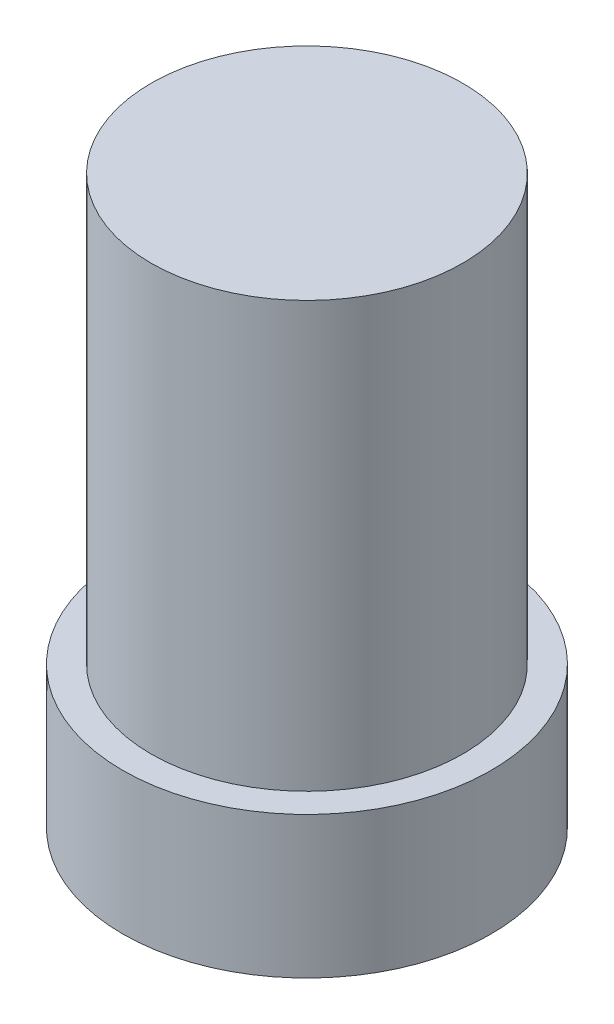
ISO-10303-21;
HEADER;
FILE_DESCRIPTION(('STEP AP214'),'2;1');
FILE_NAME('part.step','',(''),(''),'','','');
FILE_SCHEMA(('AUTOMOTIVE_DESIGN { 1 0 10303 214 1 1 1 1 }'));
ENDSEC;
DATA;
#1=APPLICATION_CONTEXT('core data for automotive mechanical design processes');
#2=APPLICATION_PROTOCOL_DEFINITION('international standard','automotive_design',2000,#1);
#3=PRODUCT_CONTEXT('',#1,'mechanical');
#4=PRODUCT('Part','Part','',(#3));
#5=PRODUCT_RELATED_PRODUCT_CATEGORY('part','',(#4));
#6=PRODUCT_DEFINITION_FORMATION('','',#4);
#7=PRODUCT_DEFINITION_CONTEXT('part definition',#1,'design');
#8=PRODUCT_DEFINITION('design','',#6,#7);
#9=PRODUCT_DEFINITION_SHAPE('','',#8);
#10=(LENGTH_UNIT() NAMED_UNIT(*) SI_UNIT(.MILLI.,.METRE.));
#11=(NAMED_UNIT(*) PLANE_ANGLE_UNIT() SI_UNIT($,.RADIAN.));
#12=(NAMED_UNIT(*) SI_UNIT($,.STERADIAN.) SOLID_ANGLE_UNIT());
#13=UNCERTAINTY_MEASURE_WITH_UNIT(LENGTH_MEASURE(1.E-05),#10,'distance_accuracy_value','');
#14=(GEOMETRIC_REPRESENTATION_CONTEXT(3) GLOBAL_UNCERTAINTY_ASSIGNED_CONTEXT((#13)) GLOBAL_UNIT_ASSIGNED_CONTEXT((#10,
#11,#12)) REPRESENTATION_CONTEXT('',''));
#15=CARTESIAN_POINT('',(0.,0.,0.));
#16=DIRECTION('',(0.,0.,1.));
#17=DIRECTION('',(1.,0.,0.));
#18=AXIS2_PLACEMENT_3D('',#15,#16,#17);
#19=CARTESIAN_POINT('',(0.,5.,0.));
#20=DIRECTION('',(0.,-1.,0.));
#21=DIRECTION('',(0.,0.,-1.));
#22=AXIS2_PLACEMENT_3D('',#19,#20,#21);
#23=CYLINDRICAL_SURFACE('',#22,6.5);
#24=CARTESIAN_POINT('',(0.,5.,0.));
#25=DIRECTION('',(0.,1.,0.));
#26=DIRECTION('',(0.,0.,1.));
#27=AXIS2_PLACEMENT_3D('',#24,#25,#26);
#28=CIRCLE('',#27,6.5);
#29=CARTESIAN_POINT('',(0.,5.,6.5));
#30=VERTEX_POINT('',#29);
#31=EDGE_CURVE('E38',#30,#30,#28,.T.);
#32=ORIENTED_EDGE('',*,*,#31,.F.);
#33=EDGE_LOOP('',(#32));
#34=FACE_BOUND('',#33,.T.);
#35=CARTESIAN_POINT('',(0.,0.,0.));
#36=DIRECTION('',(0.,1.,0.));
#37=DIRECTION('',(0.,0.,1.));
#38=AXIS2_PLACEMENT_3D('',#35,#36,#37);
#39=CIRCLE('',#38,6.5);
#40=CARTESIAN_POINT('',(0.,0.,6.5));
#41=VERTEX_POINT('',#40);
#42=EDGE_CURVE('E34',#41,#41,#39,.T.);
#43=ORIENTED_EDGE('',*,*,#42,.T.);
#44=EDGE_LOOP('',(#43));
#45=FACE_BOUND('',#44,.T.);
#46=ADVANCED_FACE('F31',(#34,#45),#23,.T.);
#47=CARTESIAN_POINT('',(0.,5.,0.));
#48=DIRECTION('',(0.,1.,0.));
#49=DIRECTION('',(0.,0.,1.));
#50=AXIS2_PLACEMENT_3D('',#47,#48,#49);
#51=PLANE('',#50);
#52=CARTESIAN_POINT('',(0.,5.,0.));
#53=DIRECTION('',(0.,1.,0.));
#54=DIRECTION('',(0.,0.,1.));
#55=AXIS2_PLACEMENT_3D('',#52,#53,#54);
#56=CIRCLE('',#55,5.5);
#57=CARTESIAN_POINT('',(0.,5.,5.5));
#58=VERTEX_POINT('',#57);
#59=EDGE_CURVE('E10',#58,#58,#56,.T.);
#60=ORIENTED_EDGE('',*,*,#59,.F.);
#61=EDGE_LOOP('',(#60));
#62=FACE_BOUND('',#61,.T.);
#63=ORIENTED_EDGE('',*,*,#31,.T.);
#64=EDGE_LOOP('',(#63));
#65=FACE_BOUND('',#64,.T.);
#66=ADVANCED_FACE('F67',(#62,#65),#51,.T.);
#67=CARTESIAN_POINT('',(0.,0.,0.));
#68=DIRECTION('',(0.,1.,0.));
#69=DIRECTION('',(0.,0.,1.));
#70=AXIS2_PLACEMENT_3D('',#67,#68,#69);
#71=PLANE('',#70);
#72=CARTESIAN_POINT('',(0.,0.,0.));
#73=DIRECTION('',(0.,-1.,0.));
#74=DIRECTION('',(0.,0.,-1.));
#75=AXIS2_PLACEMENT_3D('',#72,#73,#74);
#76=CIRCLE('',#75,6.);
#77=CARTESIAN_POINT('',(0.,0.,-6.));
#78=VERTEX_POINT('',#77);
#79=EDGE_CURVE('E48',#78,#78,#76,.T.);
#80=ORIENTED_EDGE('',*,*,#79,.F.);
#81=EDGE_LOOP('',(#80));
#82=FACE_BOUND('',#81,.T.);
#83=ORIENTED_EDGE('',*,*,#42,.F.);
#84=EDGE_LOOP('',(#83));
#85=FACE_BOUND('',#84,.T.);
#86=ADVANCED_FACE('F63',(#82,#85),#71,.F.);
#87=CARTESIAN_POINT('',(0.,20.,0.));
#88=DIRECTION('',(0.,-1.,0.));
#89=DIRECTION('',(0.,0.,-1.));
#90=AXIS2_PLACEMENT_3D('',#87,#88,#89);
#91=CYLINDRICAL_SURFACE('',#90,5.5);
#92=CARTESIAN_POINT('',(0.,20.,0.));
#93=DIRECTION('',(0.,1.,0.));
#94=DIRECTION('',(0.,0.,1.));
#95=AXIS2_PLACEMENT_3D('',#92,#93,#94);
#96=CIRCLE('',#95,5.5);
#97=CARTESIAN_POINT('',(0.,20.,5.5));
#98=VERTEX_POINT('',#97);
#99=EDGE_CURVE('E44',#98,#98,#96,.T.);
#100=ORIENTED_EDGE('',*,*,#99,.F.);
#101=EDGE_LOOP('',(#100));
#102=FACE_BOUND('',#101,.T.);
#103=ORIENTED_EDGE('',*,*,#59,.T.);
#104=EDGE_LOOP('',(#103));
#105=FACE_BOUND('',#104,.T.);
#106=ADVANCED_FACE('F66',(#102,#105),#91,.T.);
#107=CARTESIAN_POINT('',(0.,20.,0.));
#108=DIRECTION('',(0.,1.,0.));
#109=DIRECTION('',(0.,0.,1.));
#110=AXIS2_PLACEMENT_3D('',#107,#108,#109);
#111=PLANE('',#110);
#112=ORIENTED_EDGE('',*,*,#99,.T.);
#113=EDGE_LOOP('',(#112));
#114=FACE_BOUND('',#113,.T.);
#115=ADVANCED_FACE('F59',(#114),#111,.T.);
#116=CARTESIAN_POINT('',(0.,4.,0.));
#117=DIRECTION('',(0.,-1.,0.));
#118=DIRECTION('',(0.,0.,-1.));
#119=AXIS2_PLACEMENT_3D('',#116,#117,#118);
#120=CYLINDRICAL_SURFACE('',#119,6.);
#121=CARTESIAN_POINT('',(0.,4.,0.));
#122=DIRECTION('',(0.,-1.,0.));
#123=DIRECTION('',(0.,0.,-1.));
#124=AXIS2_PLACEMENT_3D('',#121,#122,#123);
#125=CIRCLE('',#124,6.);
#126=CARTESIAN_POINT('',(0.,4.,-6.));
#127=VERTEX_POINT('',#126);
#128=EDGE_CURVE('E47',#127,#127,#125,.T.);
#129=ORIENTED_EDGE('',*,*,#128,.F.);
#130=EDGE_LOOP('',(#129));
#131=FACE_BOUND('',#130,.T.);
#132=ORIENTED_EDGE('',*,*,#79,.T.);
#133=EDGE_LOOP('',(#132));
#134=FACE_BOUND('',#133,.T.);
#135=ADVANCED_FACE('F56',(#131,#134),#120,.F.);
#136=CARTESIAN_POINT('',(0.,4.,0.));
#137=DIRECTION('',(0.,-1.,0.));
#138=DIRECTION('',(0.,0.,-1.));
#139=AXIS2_PLACEMENT_3D('',#136,#137,#138);
#140=PLANE('',#139);
#141=ORIENTED_EDGE('',*,*,#128,.T.);
#142=EDGE_LOOP('',(#141));
#143=FACE_BOUND('',#142,.T.);
#144=ADVANCED_FACE('F54',(#143),#140,.T.);
#145=CLOSED_SHELL('',(#46,#66,#86,#106,#115,#135,#144));
#146=MANIFOLD_SOLID_BREP('B2',#145);
#147=ADVANCED_BREP_SHAPE_REPRESENTATION('',(#18,#146),#14);
#148=SHAPE_DEFINITION_REPRESENTATION(#9,#147);
ENDSEC;
END-ISO-10303-21;
